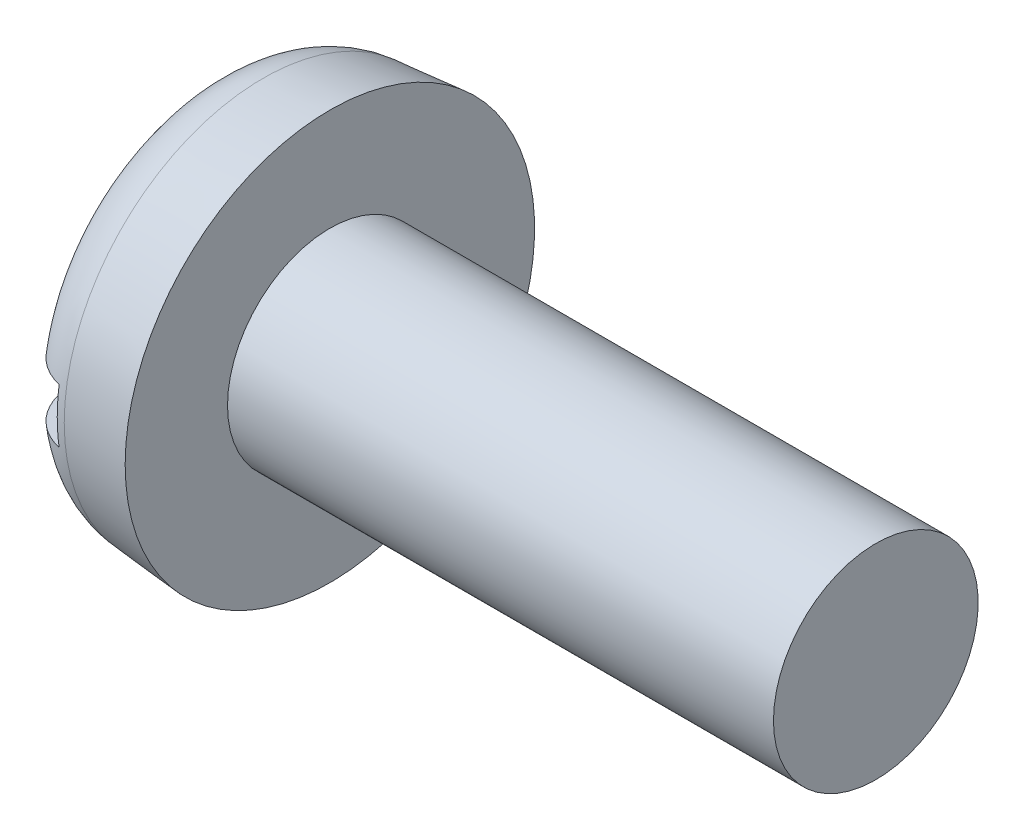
from build123d import *

# Parameters (mm, degrees)
FILLET2_R  = 1.8
SKETCH2_W  = 12
SKETCH2_H  = 1.6
SLOT_DEPTH = 1.4


with BuildPart() as part:
    # BodySke → Base-Revolve (revolve)
    with BuildSketch(Plane.XY, mode=Mode.PRIVATE) as base_revolve_sk:
        Polygon((3.6, 3), (3.6, 6), (0, 5.685040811), (0, 0), (19.6, 0), (19.6, 3), align=None)
    revolve(base_revolve_sk.sketch.rotate(Axis((-25.4, 0, 0), (1, 0, 0)), 90), axis=Axis((-25.4, 0, 0), (1, 0, 0)))

    # Fillet2
    fillet2_edges = [part.edges().sort_by_distance(p)[0] for p in [
        (0, 0, -5.685040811),
    ]]
    fillet(fillet2_edges, radius=FILLET2_R)

    # Sketch2 → Slot (cut)
    with BuildSketch(Plane(origin=(0, 0, 0), x_dir=(0, 0, -1), z_dir=(1, 0, 0))):
        Rectangle(SKETCH2_W, SKETCH2_H)
    extrude(amount=SLOT_DEPTH, mode=Mode.SUBTRACT)


solid = part.part
